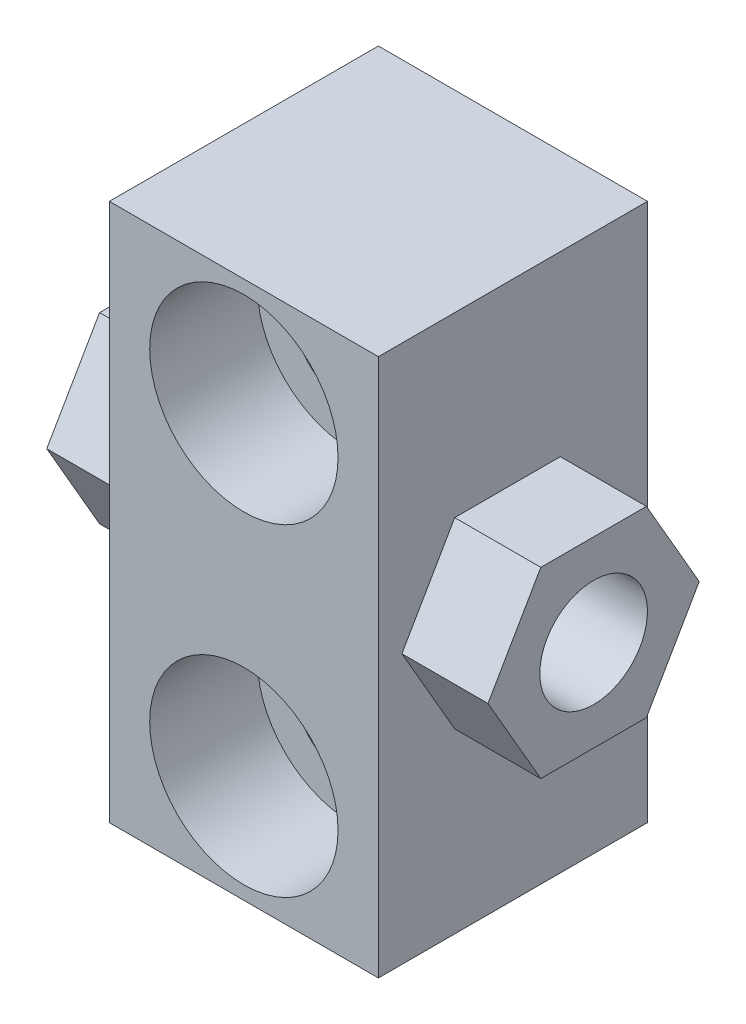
ISO-10303-21;
HEADER;
FILE_DESCRIPTION(('STEP AP214'),'2;1');
FILE_NAME('part.step','',(''),(''),'','','');
FILE_SCHEMA(('AUTOMOTIVE_DESIGN { 1 0 10303 214 1 1 1 1 }'));
ENDSEC;
DATA;
#1=APPLICATION_CONTEXT('core data for automotive mechanical design processes');
#2=APPLICATION_PROTOCOL_DEFINITION('international standard','automotive_design',2000,#1);
#3=PRODUCT_CONTEXT('',#1,'mechanical');
#4=PRODUCT('Part','Part','',(#3));
#5=PRODUCT_RELATED_PRODUCT_CATEGORY('part','',(#4));
#6=PRODUCT_DEFINITION_FORMATION('','',#4);
#7=PRODUCT_DEFINITION_CONTEXT('part definition',#1,'design');
#8=PRODUCT_DEFINITION('design','',#6,#7);
#9=PRODUCT_DEFINITION_SHAPE('','',#8);
#10=(LENGTH_UNIT() NAMED_UNIT(*) SI_UNIT(.MILLI.,.METRE.));
#11=(NAMED_UNIT(*) PLANE_ANGLE_UNIT() SI_UNIT($,.RADIAN.));
#12=(NAMED_UNIT(*) SI_UNIT($,.STERADIAN.) SOLID_ANGLE_UNIT());
#13=UNCERTAINTY_MEASURE_WITH_UNIT(LENGTH_MEASURE(1.E-05),#10,'distance_accuracy_value','');
#14=(GEOMETRIC_REPRESENTATION_CONTEXT(3) GLOBAL_UNCERTAINTY_ASSIGNED_CONTEXT((#13)) GLOBAL_UNIT_ASSIGNED_CONTEXT((#10,
#11,#12)) REPRESENTATION_CONTEXT('',''));
#15=CARTESIAN_POINT('',(0.,0.,0.));
#16=DIRECTION('',(0.,0.,1.));
#17=DIRECTION('',(1.,0.,0.));
#18=AXIS2_PLACEMENT_3D('',#15,#16,#17);
#19=CARTESIAN_POINT('',(0.,30.,25.5));
#20=DIRECTION('',(0.,0.,1.));
#21=DIRECTION('',(-1.,0.,0.));
#22=AXIS2_PLACEMENT_3D('',#19,#20,#21);
#23=CYLINDRICAL_SURFACE('',#22,5.5);
#24=CARTESIAN_POINT('',(0.,30.,0.));
#25=DIRECTION('',(0.,0.,-1.));
#26=DIRECTION('',(1.,0.,0.));
#27=AXIS2_PLACEMENT_3D('',#24,#25,#26);
#28=CIRCLE('',#27,5.5);
#29=CARTESIAN_POINT('',(5.5,30.,0.));
#30=VERTEX_POINT('',#29);
#31=EDGE_CURVE('E285',#30,#30,#28,.T.);
#32=ORIENTED_EDGE('',*,*,#31,.T.);
#33=EDGE_LOOP('',(#32));
#34=FACE_BOUND('',#33,.T.);
#35=CARTESIAN_POINT('',(0.,30.,15.));
#36=DIRECTION('',(0.,0.,1.));
#37=DIRECTION('',(-1.,0.,0.));
#38=AXIS2_PLACEMENT_3D('',#35,#36,#37);
#39=CIRCLE('',#38,5.5);
#40=CARTESIAN_POINT('',(-5.5,30.,15.));
#41=VERTEX_POINT('',#40);
#42=EDGE_CURVE('E18',#41,#41,#39,.T.);
#43=ORIENTED_EDGE('',*,*,#42,.T.);
#44=EDGE_LOOP('',(#43));
#45=FACE_BOUND('',#44,.T.);
#46=ADVANCED_FACE('F14',(#34,#45),#23,.F.);
#47=CARTESIAN_POINT('',(0.,0.,25.5));
#48=DIRECTION('',(0.,0.,1.));
#49=DIRECTION('',(-1.,0.,0.));
#50=AXIS2_PLACEMENT_3D('',#47,#48,#49);
#51=CYLINDRICAL_SURFACE('',#50,5.5);
#52=CARTESIAN_POINT('',(0.,0.,0.));
#53=DIRECTION('',(0.,0.,-1.));
#54=DIRECTION('',(1.,0.,0.));
#55=AXIS2_PLACEMENT_3D('',#52,#53,#54);
#56=CIRCLE('',#55,5.5);
#57=CARTESIAN_POINT('',(5.5,0.,0.));
#58=VERTEX_POINT('',#57);
#59=EDGE_CURVE('E288',#58,#58,#56,.T.);
#60=ORIENTED_EDGE('',*,*,#59,.T.);
#61=EDGE_LOOP('',(#60));
#62=FACE_BOUND('',#61,.T.);
#63=CARTESIAN_POINT('',(0.,0.,15.));
#64=DIRECTION('',(0.,0.,1.));
#65=DIRECTION('',(-1.,0.,0.));
#66=AXIS2_PLACEMENT_3D('',#63,#64,#65);
#67=CIRCLE('',#66,5.5);
#68=CARTESIAN_POINT('',(-5.5,0.,15.));
#69=VERTEX_POINT('',#68);
#70=EDGE_CURVE('E267',#69,#69,#67,.T.);
#71=ORIENTED_EDGE('',*,*,#70,.T.);
#72=EDGE_LOOP('',(#71));
#73=FACE_BOUND('',#72,.T.);
#74=ADVANCED_FACE('F310',(#62,#73),#51,.F.);
#75=CARTESIAN_POINT('',(12.5,40.,0.5));
#76=DIRECTION('',(-1.,0.,0.));
#77=DIRECTION('',(0.,-1.,0.));
#78=AXIS2_PLACEMENT_3D('',#75,#76,#77);
#79=PLANE('',#78);
#80=DIRECTION('',(0.,-0.866025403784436,0.5));
#81=VECTOR('',#80,1.);
#82=CARTESIAN_POINT('',(12.5,23.5,17.9074772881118));
#83=LINE('',#82,#81);
#84=CARTESIAN_POINT('',(12.5,23.5,17.9074772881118));
#85=VERTEX_POINT('',#84);
#86=CARTESIAN_POINT('',(12.5,15.,22.8149545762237));
#87=VERTEX_POINT('',#86);
#88=EDGE_CURVE('E39',#85,#87,#83,.T.);
#89=ORIENTED_EDGE('',*,*,#88,.F.);
#90=DIRECTION('',(0.,0.,-1.));
#91=VECTOR('',#90,1.);
#92=CARTESIAN_POINT('',(12.5,23.5,17.9074772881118));
#93=LINE('',#92,#91);
#94=CARTESIAN_POINT('',(12.5,23.5,8.0925227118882));
#95=VERTEX_POINT('',#94);
#96=EDGE_CURVE('E163',#85,#95,#93,.T.);
#97=ORIENTED_EDGE('',*,*,#96,.T.);
#98=DIRECTION('',(0.,-0.866025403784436,-0.5));
#99=VECTOR('',#98,1.);
#100=CARTESIAN_POINT('',(12.5,23.5,8.0925227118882));
#101=LINE('',#100,#99);
#102=CARTESIAN_POINT('',(12.5,15.,3.18504542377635));
#103=VERTEX_POINT('',#102);
#104=EDGE_CURVE('E166',#95,#103,#101,.T.);
#105=ORIENTED_EDGE('',*,*,#104,.T.);
#106=DIRECTION('',(0.,0.866025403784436,-0.5));
#107=VECTOR('',#106,1.);
#108=CARTESIAN_POINT('',(12.5,6.5,8.0925227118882));
#109=LINE('',#108,#107);
#110=CARTESIAN_POINT('',(12.5,6.5,8.0925227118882));
#111=VERTEX_POINT('',#110);
#112=EDGE_CURVE('E169',#111,#103,#109,.T.);
#113=ORIENTED_EDGE('',*,*,#112,.F.);
#114=DIRECTION('',(0.,0.,-1.));
#115=VECTOR('',#114,1.);
#116=CARTESIAN_POINT('',(12.5,6.5,17.9074772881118));
#117=LINE('',#116,#115);
#118=CARTESIAN_POINT('',(12.5,6.5,17.9074772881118));
#119=VERTEX_POINT('',#118);
#120=EDGE_CURVE('E172',#119,#111,#117,.T.);
#121=ORIENTED_EDGE('',*,*,#120,.F.);
#122=DIRECTION('',(0.,0.866025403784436,0.5));
#123=VECTOR('',#122,1.);
#124=CARTESIAN_POINT('',(12.5,6.5,17.9074772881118));
#125=LINE('',#124,#123);
#126=EDGE_CURVE('E175',#119,#87,#125,.T.);
#127=ORIENTED_EDGE('',*,*,#126,.T.);
#128=EDGE_LOOP('',(#89,#97,#105,#113,#121,#127));
#129=FACE_BOUND('',#128,.T.);
#130=DIRECTION('',(0.,1.,0.));
#131=VECTOR('',#130,1.);
#132=CARTESIAN_POINT('',(12.5,-10.,25.));
#133=LINE('',#132,#131);
#134=CARTESIAN_POINT('',(12.5,-10.,25.));
#135=VERTEX_POINT('',#134);
#136=CARTESIAN_POINT('',(12.5,40.,25.));
#137=VERTEX_POINT('',#136);
#138=EDGE_CURVE('E127',#135,#137,#133,.T.);
#139=ORIENTED_EDGE('',*,*,#138,.F.);
#140=DIRECTION('',(0.,0.,1.));
#141=VECTOR('',#140,1.);
#142=CARTESIAN_POINT('',(12.5,-10.,0.5));
#143=LINE('',#142,#141);
#144=CARTESIAN_POINT('',(12.5,-10.,0.));
#145=VERTEX_POINT('',#144);
#146=EDGE_CURVE('E23',#145,#135,#143,.T.);
#147=ORIENTED_EDGE('',*,*,#146,.F.);
#148=DIRECTION('',(0.,-1.,0.));
#149=VECTOR('',#148,1.);
#150=CARTESIAN_POINT('',(12.5,40.,0.));
#151=LINE('',#150,#149);
#152=CARTESIAN_POINT('',(12.5,40.,0.));
#153=VERTEX_POINT('',#152);
#154=EDGE_CURVE('E144',#153,#145,#151,.T.);
#155=ORIENTED_EDGE('',*,*,#154,.F.);
#156=DIRECTION('',(0.,0.,1.));
#157=VECTOR('',#156,1.);
#158=CARTESIAN_POINT('',(12.5,40.,0.5));
#159=LINE('',#158,#157);
#160=EDGE_CURVE('E9',#153,#137,#159,.T.);
#161=ORIENTED_EDGE('',*,*,#160,.T.);
#162=EDGE_LOOP('',(#139,#147,#155,#161));
#163=FACE_BOUND('',#162,.T.);
#164=ADVANCED_FACE('F16',(#129,#163),#79,.F.);
#165=CARTESIAN_POINT('',(12.5,40.,0.5));
#166=DIRECTION('',(0.,1.,0.));
#167=DIRECTION('',(-1.,0.,0.));
#168=AXIS2_PLACEMENT_3D('',#165,#166,#167);
#169=PLANE('',#168);
#170=DIRECTION('',(0.,0.,1.));
#171=VECTOR('',#170,1.);
#172=CARTESIAN_POINT('',(-12.5,40.,0.5));
#173=LINE('',#172,#171);
#174=CARTESIAN_POINT('',(-12.5,40.,0.));
#175=VERTEX_POINT('',#174);
#176=CARTESIAN_POINT('',(-12.5,40.,25.));
#177=VERTEX_POINT('',#176);
#178=EDGE_CURVE('E139',#175,#177,#173,.T.);
#179=ORIENTED_EDGE('',*,*,#178,.T.);
#180=DIRECTION('',(-1.,0.,0.));
#181=VECTOR('',#180,1.);
#182=CARTESIAN_POINT('',(12.5,40.,25.));
#183=LINE('',#182,#181);
#184=EDGE_CURVE('E31',#137,#177,#183,.T.);
#185=ORIENTED_EDGE('',*,*,#184,.F.);
#186=ORIENTED_EDGE('',*,*,#160,.F.);
#187=DIRECTION('',(1.,0.,0.));
#188=VECTOR('',#187,1.);
#189=CARTESIAN_POINT('',(-12.5,40.,0.));
#190=LINE('',#189,#188);
#191=EDGE_CURVE('E149',#175,#153,#190,.T.);
#192=ORIENTED_EDGE('',*,*,#191,.F.);
#193=EDGE_LOOP('',(#179,#185,#186,#192));
#194=FACE_BOUND('',#193,.T.);
#195=ADVANCED_FACE('F136',(#194),#169,.T.);
#196=CARTESIAN_POINT('',(-12.5,-10.,0.5));
#197=DIRECTION('',(0.,-1.,0.));
#198=DIRECTION('',(1.,0.,0.));
#199=AXIS2_PLACEMENT_3D('',#196,#197,#198);
#200=PLANE('',#199);
#201=ORIENTED_EDGE('',*,*,#146,.T.);
#202=DIRECTION('',(1.,0.,0.));
#203=VECTOR('',#202,1.);
#204=CARTESIAN_POINT('',(-12.5,-10.,25.));
#205=LINE('',#204,#203);
#206=CARTESIAN_POINT('',(-12.5,-10.,25.));
#207=VERTEX_POINT('',#206);
#208=EDGE_CURVE('E130',#207,#135,#205,.T.);
#209=ORIENTED_EDGE('',*,*,#208,.F.);
#210=DIRECTION('',(0.,0.,1.));
#211=VECTOR('',#210,1.);
#212=CARTESIAN_POINT('',(-12.5,-10.,0.5));
#213=LINE('',#212,#211);
#214=CARTESIAN_POINT('',(-12.5,-10.,0.));
#215=VERTEX_POINT('',#214);
#216=EDGE_CURVE('E260',#215,#207,#213,.T.);
#217=ORIENTED_EDGE('',*,*,#216,.F.);
#218=DIRECTION('',(-1.,0.,0.));
#219=VECTOR('',#218,1.);
#220=CARTESIAN_POINT('',(12.5,-10.,0.));
#221=LINE('',#220,#219);
#222=EDGE_CURVE('E148',#145,#215,#221,.T.);
#223=ORIENTED_EDGE('',*,*,#222,.F.);
#224=EDGE_LOOP('',(#201,#209,#217,#223));
#225=FACE_BOUND('',#224,.T.);
#226=ADVANCED_FACE('F297',(#225),#200,.T.);
#227=CARTESIAN_POINT('',(-12.5,-10.,0.5));
#228=DIRECTION('',(1.,0.,0.));
#229=DIRECTION('',(0.,1.,0.));
#230=AXIS2_PLACEMENT_3D('',#227,#228,#229);
#231=PLANE('',#230);
#232=DIRECTION('',(0.,0.,-1.));
#233=VECTOR('',#232,1.);
#234=CARTESIAN_POINT('',(-12.5,23.5,17.9074772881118));
#235=LINE('',#234,#233);
#236=CARTESIAN_POINT('',(-12.5,23.5,17.9074772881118));
#237=VERTEX_POINT('',#236);
#238=CARTESIAN_POINT('',(-12.5,23.5,8.0925227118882));
#239=VERTEX_POINT('',#238);
#240=EDGE_CURVE('E220',#237,#239,#235,.T.);
#241=ORIENTED_EDGE('',*,*,#240,.F.);
#242=DIRECTION('',(0.,-0.866025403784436,0.5));
#243=VECTOR('',#242,1.);
#244=CARTESIAN_POINT('',(-12.5,23.5,17.9074772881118));
#245=LINE('',#244,#243);
#246=CARTESIAN_POINT('',(-12.5,15.,22.8149545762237));
#247=VERTEX_POINT('',#246);
#248=EDGE_CURVE('E208',#237,#247,#245,.T.);
#249=ORIENTED_EDGE('',*,*,#248,.T.);
#250=DIRECTION('',(0.,0.866025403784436,0.5));
#251=VECTOR('',#250,1.);
#252=CARTESIAN_POINT('',(-12.5,6.5,17.9074772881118));
#253=LINE('',#252,#251);
#254=CARTESIAN_POINT('',(-12.5,6.5,17.9074772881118));
#255=VERTEX_POINT('',#254);
#256=EDGE_CURVE('E210',#255,#247,#253,.T.);
#257=ORIENTED_EDGE('',*,*,#256,.F.);
#258=DIRECTION('',(0.,0.,-1.));
#259=VECTOR('',#258,1.);
#260=CARTESIAN_POINT('',(-12.5,6.5,17.9074772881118));
#261=LINE('',#260,#259);
#262=CARTESIAN_POINT('',(-12.5,6.5,8.0925227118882));
#263=VERTEX_POINT('',#262);
#264=EDGE_CURVE('E213',#255,#263,#261,.T.);
#265=ORIENTED_EDGE('',*,*,#264,.T.);
#266=DIRECTION('',(0.,0.866025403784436,-0.5));
#267=VECTOR('',#266,1.);
#268=CARTESIAN_POINT('',(-12.5,6.5,8.0925227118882));
#269=LINE('',#268,#267);
#270=CARTESIAN_POINT('',(-12.5,15.,3.18504542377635));
#271=VERTEX_POINT('',#270);
#272=EDGE_CURVE('E215',#263,#271,#269,.T.);
#273=ORIENTED_EDGE('',*,*,#272,.T.);
#274=DIRECTION('',(0.,-0.866025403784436,-0.5));
#275=VECTOR('',#274,1.);
#276=CARTESIAN_POINT('',(-12.5,23.5,8.0925227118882));
#277=LINE('',#276,#275);
#278=EDGE_CURVE('E217',#239,#271,#277,.T.);
#279=ORIENTED_EDGE('',*,*,#278,.F.);
#280=EDGE_LOOP('',(#241,#249,#257,#265,#273,#279));
#281=FACE_BOUND('',#280,.T.);
#282=DIRECTION('',(0.,-1.,0.));
#283=VECTOR('',#282,1.);
#284=CARTESIAN_POINT('',(-12.5,40.,25.));
#285=LINE('',#284,#283);
#286=EDGE_CURVE('E140',#177,#207,#285,.T.);
#287=ORIENTED_EDGE('',*,*,#286,.F.);
#288=ORIENTED_EDGE('',*,*,#178,.F.);
#289=DIRECTION('',(0.,1.,0.));
#290=VECTOR('',#289,1.);
#291=CARTESIAN_POINT('',(-12.5,-10.,0.));
#292=LINE('',#291,#290);
#293=EDGE_CURVE('E153',#215,#175,#292,.T.);
#294=ORIENTED_EDGE('',*,*,#293,.F.);
#295=ORIENTED_EDGE('',*,*,#216,.T.);
#296=EDGE_LOOP('',(#287,#288,#294,#295));
#297=FACE_BOUND('',#296,.T.);
#298=ADVANCED_FACE('F295',(#281,#297),#231,.F.);
#299=CARTESIAN_POINT('',(0.,30.,25.5));
#300=DIRECTION('',(0.,0.,1.));
#301=DIRECTION('',(-1.,0.,0.));
#302=AXIS2_PLACEMENT_3D('',#299,#300,#301);
#303=CYLINDRICAL_SURFACE('',#302,8.75);
#304=CARTESIAN_POINT('',(0.,30.,25.));
#305=DIRECTION('',(0.,0.,1.));
#306=DIRECTION('',(-1.,0.,0.));
#307=AXIS2_PLACEMENT_3D('',#304,#305,#306);
#308=CIRCLE('',#307,8.75);
#309=CARTESIAN_POINT('',(-8.75,30.,25.));
#310=VERTEX_POINT('',#309);
#311=EDGE_CURVE('E266',#310,#310,#308,.T.);
#312=ORIENTED_EDGE('',*,*,#311,.T.);
#313=EDGE_LOOP('',(#312));
#314=FACE_BOUND('',#313,.T.);
#315=CARTESIAN_POINT('',(0.,30.,15.));
#316=DIRECTION('',(0.,0.,1.));
#317=DIRECTION('',(-1.,0.,0.));
#318=AXIS2_PLACEMENT_3D('',#315,#316,#317);
#319=CIRCLE('',#318,8.75);
#320=CARTESIAN_POINT('',(-8.75,30.,15.));
#321=VERTEX_POINT('',#320);
#322=EDGE_CURVE('E269',#321,#321,#319,.T.);
#323=ORIENTED_EDGE('',*,*,#322,.F.);
#324=EDGE_LOOP('',(#323));
#325=FACE_BOUND('',#324,.T.);
#326=ADVANCED_FACE('F305',(#314,#325),#303,.F.);
#327=CARTESIAN_POINT('',(0.,0.,25.5));
#328=DIRECTION('',(0.,0.,1.));
#329=DIRECTION('',(-1.,0.,0.));
#330=AXIS2_PLACEMENT_3D('',#327,#328,#329);
#331=CYLINDRICAL_SURFACE('',#330,8.75);
#332=CARTESIAN_POINT('',(0.,0.,25.));
#333=DIRECTION('',(0.,0.,1.));
#334=DIRECTION('',(-1.,0.,0.));
#335=AXIS2_PLACEMENT_3D('',#332,#333,#334);
#336=CIRCLE('',#335,8.75);
#337=CARTESIAN_POINT('',(-8.75,0.,25.));
#338=VERTEX_POINT('',#337);
#339=EDGE_CURVE('E264',#338,#338,#336,.T.);
#340=ORIENTED_EDGE('',*,*,#339,.T.);
#341=EDGE_LOOP('',(#340));
#342=FACE_BOUND('',#341,.T.);
#343=CARTESIAN_POINT('',(0.,0.,15.));
#344=DIRECTION('',(0.,0.,1.));
#345=DIRECTION('',(-1.,0.,0.));
#346=AXIS2_PLACEMENT_3D('',#343,#344,#345);
#347=CIRCLE('',#346,8.75);
#348=CARTESIAN_POINT('',(-8.75,0.,15.));
#349=VERTEX_POINT('',#348);
#350=EDGE_CURVE('E274',#349,#349,#347,.T.);
#351=ORIENTED_EDGE('',*,*,#350,.F.);
#352=EDGE_LOOP('',(#351));
#353=FACE_BOUND('',#352,.T.);
#354=ADVANCED_FACE('F322',(#342,#353),#331,.F.);
#355=CARTESIAN_POINT('',(-20.5,23.5,17.9074772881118));
#356=DIRECTION('',(0.,0.5,0.866025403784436));
#357=DIRECTION('',(0.,0.866025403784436,-0.5));
#358=AXIS2_PLACEMENT_3D('',#355,#356,#357);
#359=PLANE('',#358);
#360=DIRECTION('',(1.,0.,0.));
#361=VECTOR('',#360,1.);
#362=CARTESIAN_POINT('',(-20.5,23.5,17.9074772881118));
#363=LINE('',#362,#361);
#364=CARTESIAN_POINT('',(-20.5,23.5,17.9074772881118));
#365=VERTEX_POINT('',#364);
#366=EDGE_CURVE('E256',#365,#237,#363,.T.);
#367=ORIENTED_EDGE('',*,*,#366,.F.);
#368=DIRECTION('',(0.,-0.866025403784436,0.5));
#369=VECTOR('',#368,1.);
#370=CARTESIAN_POINT('',(-20.5,23.5,17.9074772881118));
#371=LINE('',#370,#369);
#372=CARTESIAN_POINT('',(-20.5,15.,22.8149545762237));
#373=VERTEX_POINT('',#372);
#374=EDGE_CURVE('E223',#365,#373,#371,.T.);
#375=ORIENTED_EDGE('',*,*,#374,.T.);
#376=DIRECTION('',(1.,0.,0.));
#377=VECTOR('',#376,1.);
#378=CARTESIAN_POINT('',(-20.5,15.,22.8149545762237));
#379=LINE('',#378,#377);
#380=EDGE_CURVE('E241',#373,#247,#379,.T.);
#381=ORIENTED_EDGE('',*,*,#380,.T.);
#382=ORIENTED_EDGE('',*,*,#248,.F.);
#383=EDGE_LOOP('',(#367,#375,#381,#382));
#384=FACE_BOUND('',#383,.T.);
#385=ADVANCED_FACE('F327',(#384),#359,.T.);
#386=CARTESIAN_POINT('',(-20.5,23.5,17.9074772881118));
#387=DIRECTION('',(0.,-1.,0.));
#388=DIRECTION('',(1.,0.,0.));
#389=AXIS2_PLACEMENT_3D('',#386,#387,#388);
#390=PLANE('',#389);
#391=DIRECTION('',(1.,0.,0.));
#392=VECTOR('',#391,1.);
#393=CARTESIAN_POINT('',(-20.5,23.5,8.0925227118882));
#394=LINE('',#393,#392);
#395=CARTESIAN_POINT('',(-20.5,23.5,8.0925227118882));
#396=VERTEX_POINT('',#395);
#397=EDGE_CURVE('E253',#396,#239,#394,.T.);
#398=ORIENTED_EDGE('',*,*,#397,.F.);
#399=DIRECTION('',(0.,0.,-1.));
#400=VECTOR('',#399,1.);
#401=CARTESIAN_POINT('',(-20.5,23.5,17.9074772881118));
#402=LINE('',#401,#400);
#403=EDGE_CURVE('E238',#365,#396,#402,.T.);
#404=ORIENTED_EDGE('',*,*,#403,.F.);
#405=ORIENTED_EDGE('',*,*,#366,.T.);
#406=ORIENTED_EDGE('',*,*,#240,.T.);
#407=EDGE_LOOP('',(#398,#404,#405,#406));
#408=FACE_BOUND('',#407,.T.);
#409=ADVANCED_FACE('F329',(#408),#390,.F.);
#410=CARTESIAN_POINT('',(-20.5,23.5,8.0925227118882));
#411=DIRECTION('',(0.,-0.5,0.866025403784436));
#412=DIRECTION('',(0.,0.866025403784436,0.5));
#413=AXIS2_PLACEMENT_3D('',#410,#411,#412);
#414=PLANE('',#413);
#415=DIRECTION('',(1.,0.,0.));
#416=VECTOR('',#415,1.);
#417=CARTESIAN_POINT('',(-20.5,15.,3.18504542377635));
#418=LINE('',#417,#416);
#419=CARTESIAN_POINT('',(-20.5,15.,3.18504542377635));
#420=VERTEX_POINT('',#419);
#421=EDGE_CURVE('E250',#420,#271,#418,.T.);
#422=ORIENTED_EDGE('',*,*,#421,.F.);
#423=DIRECTION('',(0.,-0.866025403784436,-0.5));
#424=VECTOR('',#423,1.);
#425=CARTESIAN_POINT('',(-20.5,23.5,8.0925227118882));
#426=LINE('',#425,#424);
#427=EDGE_CURVE('E235',#396,#420,#426,.T.);
#428=ORIENTED_EDGE('',*,*,#427,.F.);
#429=ORIENTED_EDGE('',*,*,#397,.T.);
#430=ORIENTED_EDGE('',*,*,#278,.T.);
#431=EDGE_LOOP('',(#422,#428,#429,#430));
#432=FACE_BOUND('',#431,.T.);
#433=ADVANCED_FACE('F332',(#432),#414,.F.);
#434=CARTESIAN_POINT('',(-20.5,6.5,8.0925227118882));
#435=DIRECTION('',(0.,-0.5,-0.866025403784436));
#436=DIRECTION('',(0.,-0.866025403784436,0.5));
#437=AXIS2_PLACEMENT_3D('',#434,#435,#436);
#438=PLANE('',#437);
#439=DIRECTION('',(1.,0.,0.));
#440=VECTOR('',#439,1.);
#441=CARTESIAN_POINT('',(-20.5,6.5,8.0925227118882));
#442=LINE('',#441,#440);
#443=CARTESIAN_POINT('',(-20.5,6.5,8.0925227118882));
#444=VERTEX_POINT('',#443);
#445=EDGE_CURVE('E247',#444,#263,#442,.T.);
#446=ORIENTED_EDGE('',*,*,#445,.F.);
#447=DIRECTION('',(0.,0.866025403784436,-0.5));
#448=VECTOR('',#447,1.);
#449=CARTESIAN_POINT('',(-20.5,6.5,8.0925227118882));
#450=LINE('',#449,#448);
#451=EDGE_CURVE('E232',#444,#420,#450,.T.);
#452=ORIENTED_EDGE('',*,*,#451,.T.);
#453=ORIENTED_EDGE('',*,*,#421,.T.);
#454=ORIENTED_EDGE('',*,*,#272,.F.);
#455=EDGE_LOOP('',(#446,#452,#453,#454));
#456=FACE_BOUND('',#455,.T.);
#457=ADVANCED_FACE('F336',(#456),#438,.T.);
#458=CARTESIAN_POINT('',(-20.5,6.5,17.9074772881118));
#459=DIRECTION('',(0.,-1.,0.));
#460=DIRECTION('',(1.,0.,0.));
#461=AXIS2_PLACEMENT_3D('',#458,#459,#460);
#462=PLANE('',#461);
#463=DIRECTION('',(1.,0.,0.));
#464=VECTOR('',#463,1.);
#465=CARTESIAN_POINT('',(-20.5,6.5,17.9074772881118));
#466=LINE('',#465,#464);
#467=CARTESIAN_POINT('',(-20.5,6.5,17.9074772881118));
#468=VERTEX_POINT('',#467);
#469=EDGE_CURVE('E244',#468,#255,#466,.T.);
#470=ORIENTED_EDGE('',*,*,#469,.F.);
#471=DIRECTION('',(0.,0.,-1.));
#472=VECTOR('',#471,1.);
#473=CARTESIAN_POINT('',(-20.5,6.5,17.9074772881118));
#474=LINE('',#473,#472);
#475=EDGE_CURVE('E229',#468,#444,#474,.T.);
#476=ORIENTED_EDGE('',*,*,#475,.T.);
#477=ORIENTED_EDGE('',*,*,#445,.T.);
#478=ORIENTED_EDGE('',*,*,#264,.F.);
#479=EDGE_LOOP('',(#470,#476,#477,#478));
#480=FACE_BOUND('',#479,.T.);
#481=ADVANCED_FACE('F340',(#480),#462,.T.);
#482=CARTESIAN_POINT('',(-20.5,6.5,17.9074772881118));
#483=DIRECTION('',(0.,0.5,-0.866025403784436));
#484=DIRECTION('',(0.,-0.866025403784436,-0.5));
#485=AXIS2_PLACEMENT_3D('',#482,#483,#484);
#486=PLANE('',#485);
#487=DIRECTION('',(0.,0.866025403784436,0.5));
#488=VECTOR('',#487,1.);
#489=CARTESIAN_POINT('',(-20.5,6.5,17.9074772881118));
#490=LINE('',#489,#488);
#491=EDGE_CURVE('E226',#468,#373,#490,.T.);
#492=ORIENTED_EDGE('',*,*,#491,.F.);
#493=ORIENTED_EDGE('',*,*,#469,.T.);
#494=ORIENTED_EDGE('',*,*,#256,.T.);
#495=ORIENTED_EDGE('',*,*,#380,.F.);
#496=EDGE_LOOP('',(#492,#493,#494,#495));
#497=FACE_BOUND('',#496,.T.);
#498=ADVANCED_FACE('F344',(#497),#486,.F.);
#499=CARTESIAN_POINT('',(-20.5,15.,22.8149545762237));
#500=DIRECTION('',(-1.,0.,0.));
#501=DIRECTION('',(0.,-1.,0.));
#502=AXIS2_PLACEMENT_3D('',#499,#500,#501);
#503=PLANE('',#502);
#504=CARTESIAN_POINT('',(-20.5,15.,13.));
#505=DIRECTION('',(-1.,0.,0.));
#506=DIRECTION('',(0.,-1.,0.));
#507=AXIS2_PLACEMENT_3D('',#504,#505,#506);
#508=CIRCLE('',#507,5.);
#509=CARTESIAN_POINT('',(-20.5,10.,13.));
#510=VERTEX_POINT('',#509);
#511=EDGE_CURVE('E151',#510,#510,#508,.T.);
#512=ORIENTED_EDGE('',*,*,#511,.F.);
#513=EDGE_LOOP('',(#512));
#514=FACE_BOUND('',#513,.T.);
#515=ORIENTED_EDGE('',*,*,#374,.F.);
#516=ORIENTED_EDGE('',*,*,#403,.T.);
#517=ORIENTED_EDGE('',*,*,#427,.T.);
#518=ORIENTED_EDGE('',*,*,#451,.F.);
#519=ORIENTED_EDGE('',*,*,#475,.F.);
#520=ORIENTED_EDGE('',*,*,#491,.T.);
#521=EDGE_LOOP('',(#515,#516,#517,#518,#519,#520));
#522=FACE_BOUND('',#521,.T.);
#523=ADVANCED_FACE('F346',(#514,#522),#503,.T.);
#524=CARTESIAN_POINT('',(20.5,23.5,17.9074772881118));
#525=DIRECTION('',(0.,-0.5,-0.866025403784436));
#526=DIRECTION('',(0.,-0.866025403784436,0.5));
#527=AXIS2_PLACEMENT_3D('',#524,#525,#526);
#528=PLANE('',#527);
#529=DIRECTION('',(-1.,0.,0.));
#530=VECTOR('',#529,1.);
#531=CARTESIAN_POINT('',(20.5,15.,22.8149545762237));
#532=LINE('',#531,#530);
#533=CARTESIAN_POINT('',(20.5,15.,22.8149545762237));
#534=VERTEX_POINT('',#533);
#535=EDGE_CURVE('E206',#534,#87,#532,.T.);
#536=ORIENTED_EDGE('',*,*,#535,.F.);
#537=DIRECTION('',(0.,-0.866025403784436,0.5));
#538=VECTOR('',#537,1.);
#539=CARTESIAN_POINT('',(20.5,23.5,17.9074772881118));
#540=LINE('',#539,#538);
#541=CARTESIAN_POINT('',(20.5,23.5,17.9074772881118));
#542=VERTEX_POINT('',#541);
#543=EDGE_CURVE('E178',#542,#534,#540,.T.);
#544=ORIENTED_EDGE('',*,*,#543,.F.);
#545=DIRECTION('',(-1.,0.,0.));
#546=VECTOR('',#545,1.);
#547=CARTESIAN_POINT('',(20.5,23.5,17.9074772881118));
#548=LINE('',#547,#546);
#549=EDGE_CURVE('E196',#542,#85,#548,.T.);
#550=ORIENTED_EDGE('',*,*,#549,.T.);
#551=ORIENTED_EDGE('',*,*,#88,.T.);
#552=EDGE_LOOP('',(#536,#544,#550,#551));
#553=FACE_BOUND('',#552,.T.);
#554=ADVANCED_FACE('F350',(#553),#528,.F.);
#555=CARTESIAN_POINT('',(20.5,6.5,17.9074772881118));
#556=DIRECTION('',(0.,-0.5,0.866025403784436));
#557=DIRECTION('',(0.,0.866025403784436,0.5));
#558=AXIS2_PLACEMENT_3D('',#555,#556,#557);
#559=PLANE('',#558);
#560=DIRECTION('',(-1.,0.,0.));
#561=VECTOR('',#560,1.);
#562=CARTESIAN_POINT('',(20.5,6.5,17.9074772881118));
#563=LINE('',#562,#561);
#564=CARTESIAN_POINT('',(20.5,6.5,17.9074772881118));
#565=VERTEX_POINT('',#564);
#566=EDGE_CURVE('E204',#565,#119,#563,.T.);
#567=ORIENTED_EDGE('',*,*,#566,.F.);
#568=DIRECTION('',(0.,0.866025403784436,0.5));
#569=VECTOR('',#568,1.);
#570=CARTESIAN_POINT('',(20.5,6.5,17.9074772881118));
#571=LINE('',#570,#569);
#572=EDGE_CURVE('E193',#565,#534,#571,.T.);
#573=ORIENTED_EDGE('',*,*,#572,.T.);
#574=ORIENTED_EDGE('',*,*,#535,.T.);
#575=ORIENTED_EDGE('',*,*,#126,.F.);
#576=EDGE_LOOP('',(#567,#573,#574,#575));
#577=FACE_BOUND('',#576,.T.);
#578=ADVANCED_FACE('F357',(#577),#559,.T.);
#579=CARTESIAN_POINT('',(20.5,6.5,17.9074772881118));
#580=DIRECTION('',(0.,1.,0.));
#581=DIRECTION('',(-1.,0.,0.));
#582=AXIS2_PLACEMENT_3D('',#579,#580,#581);
#583=PLANE('',#582);
#584=DIRECTION('',(-1.,0.,0.));
#585=VECTOR('',#584,1.);
#586=CARTESIAN_POINT('',(20.5,6.5,8.0925227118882));
#587=LINE('',#586,#585);
#588=CARTESIAN_POINT('',(20.5,6.5,8.0925227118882));
#589=VERTEX_POINT('',#588);
#590=EDGE_CURVE('E202',#589,#111,#587,.T.);
#591=ORIENTED_EDGE('',*,*,#590,.F.);
#592=DIRECTION('',(0.,0.,-1.));
#593=VECTOR('',#592,1.);
#594=CARTESIAN_POINT('',(20.5,6.5,17.9074772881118));
#595=LINE('',#594,#593);
#596=EDGE_CURVE('E190',#565,#589,#595,.T.);
#597=ORIENTED_EDGE('',*,*,#596,.F.);
#598=ORIENTED_EDGE('',*,*,#566,.T.);
#599=ORIENTED_EDGE('',*,*,#120,.T.);
#600=EDGE_LOOP('',(#591,#597,#598,#599));
#601=FACE_BOUND('',#600,.T.);
#602=ADVANCED_FACE('F360',(#601),#583,.F.);
#603=CARTESIAN_POINT('',(20.5,6.5,8.0925227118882));
#604=DIRECTION('',(0.,0.5,0.866025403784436));
#605=DIRECTION('',(0.,0.866025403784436,-0.5));
#606=AXIS2_PLACEMENT_3D('',#603,#604,#605);
#607=PLANE('',#606);
#608=DIRECTION('',(-1.,0.,0.));
#609=VECTOR('',#608,1.);
#610=CARTESIAN_POINT('',(20.5,15.,3.18504542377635));
#611=LINE('',#610,#609);
#612=CARTESIAN_POINT('',(20.5,15.,3.18504542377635));
#613=VERTEX_POINT('',#612);
#614=EDGE_CURVE('E200',#613,#103,#611,.T.);
#615=ORIENTED_EDGE('',*,*,#614,.F.);
#616=DIRECTION('',(0.,0.866025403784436,-0.5));
#617=VECTOR('',#616,1.);
#618=CARTESIAN_POINT('',(20.5,6.5,8.0925227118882));
#619=LINE('',#618,#617);
#620=EDGE_CURVE('E187',#589,#613,#619,.T.);
#621=ORIENTED_EDGE('',*,*,#620,.F.);
#622=ORIENTED_EDGE('',*,*,#590,.T.);
#623=ORIENTED_EDGE('',*,*,#112,.T.);
#624=EDGE_LOOP('',(#615,#621,#622,#623));
#625=FACE_BOUND('',#624,.T.);
#626=ADVANCED_FACE('F364',(#625),#607,.F.);
#627=CARTESIAN_POINT('',(20.5,23.5,8.0925227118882));
#628=DIRECTION('',(0.,0.5,-0.866025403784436));
#629=DIRECTION('',(0.,-0.866025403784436,-0.5));
#630=AXIS2_PLACEMENT_3D('',#627,#628,#629);
#631=PLANE('',#630);
#632=DIRECTION('',(-1.,0.,0.));
#633=VECTOR('',#632,1.);
#634=CARTESIAN_POINT('',(20.5,23.5,8.0925227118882));
#635=LINE('',#634,#633);
#636=CARTESIAN_POINT('',(20.5,23.5,8.0925227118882));
#637=VERTEX_POINT('',#636);
#638=EDGE_CURVE('E198',#637,#95,#635,.T.);
#639=ORIENTED_EDGE('',*,*,#638,.F.);
#640=DIRECTION('',(0.,-0.866025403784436,-0.5));
#641=VECTOR('',#640,1.);
#642=CARTESIAN_POINT('',(20.5,23.5,8.0925227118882));
#643=LINE('',#642,#641);
#644=EDGE_CURVE('E184',#637,#613,#643,.T.);
#645=ORIENTED_EDGE('',*,*,#644,.T.);
#646=ORIENTED_EDGE('',*,*,#614,.T.);
#647=ORIENTED_EDGE('',*,*,#104,.F.);
#648=EDGE_LOOP('',(#639,#645,#646,#647));
#649=FACE_BOUND('',#648,.T.);
#650=ADVANCED_FACE('F368',(#649),#631,.T.);
#651=CARTESIAN_POINT('',(20.5,23.5,17.9074772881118));
#652=DIRECTION('',(0.,1.,0.));
#653=DIRECTION('',(-1.,0.,0.));
#654=AXIS2_PLACEMENT_3D('',#651,#652,#653);
#655=PLANE('',#654);
#656=DIRECTION('',(0.,0.,-1.));
#657=VECTOR('',#656,1.);
#658=CARTESIAN_POINT('',(20.5,23.5,17.9074772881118));
#659=LINE('',#658,#657);
#660=EDGE_CURVE('E181',#542,#637,#659,.T.);
#661=ORIENTED_EDGE('',*,*,#660,.T.);
#662=ORIENTED_EDGE('',*,*,#638,.T.);
#663=ORIENTED_EDGE('',*,*,#96,.F.);
#664=ORIENTED_EDGE('',*,*,#549,.F.);
#665=EDGE_LOOP('',(#661,#662,#663,#664));
#666=FACE_BOUND('',#665,.T.);
#667=ADVANCED_FACE('F372',(#666),#655,.T.);
#668=CARTESIAN_POINT('',(20.5,15.,22.8149545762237));
#669=DIRECTION('',(1.,0.,0.));
#670=DIRECTION('',(0.,-1.,0.));
#671=AXIS2_PLACEMENT_3D('',#668,#669,#670);
#672=PLANE('',#671);
#673=CARTESIAN_POINT('',(20.5,15.,13.));
#674=DIRECTION('',(-1.,0.,0.));
#675=DIRECTION('',(0.,-1.,0.));
#676=AXIS2_PLACEMENT_3D('',#673,#674,#675);
#677=CIRCLE('',#676,5.);
#678=CARTESIAN_POINT('',(20.5,10.,13.));
#679=VERTEX_POINT('',#678);
#680=EDGE_CURVE('E159',#679,#679,#677,.T.);
#681=ORIENTED_EDGE('',*,*,#680,.T.);
#682=EDGE_LOOP('',(#681));
#683=FACE_BOUND('',#682,.T.);
#684=ORIENTED_EDGE('',*,*,#543,.T.);
#685=ORIENTED_EDGE('',*,*,#572,.F.);
#686=ORIENTED_EDGE('',*,*,#596,.T.);
#687=ORIENTED_EDGE('',*,*,#620,.T.);
#688=ORIENTED_EDGE('',*,*,#644,.F.);
#689=ORIENTED_EDGE('',*,*,#660,.F.);
#690=EDGE_LOOP('',(#684,#685,#686,#687,#688,#689));
#691=FACE_BOUND('',#690,.T.);
#692=ADVANCED_FACE('F374',(#683,#691),#672,.T.);
#693=CARTESIAN_POINT('',(20.5,15.,13.));
#694=DIRECTION('',(-1.,0.,0.));
#695=DIRECTION('',(0.,-1.,0.));
#696=AXIS2_PLACEMENT_3D('',#693,#694,#695);
#697=CYLINDRICAL_SURFACE('',#696,5.);
#698=ORIENTED_EDGE('',*,*,#680,.F.);
#699=EDGE_LOOP('',(#698));
#700=FACE_BOUND('',#699,.T.);
#701=ORIENTED_EDGE('',*,*,#511,.T.);
#702=EDGE_LOOP('',(#701));
#703=FACE_BOUND('',#702,.T.);
#704=ADVANCED_FACE('F378',(#700,#703),#697,.F.);
#705=CARTESIAN_POINT('',(0.,15.,0.));
#706=DIRECTION('',(0.,0.,-1.));
#707=DIRECTION('',(1.,0.,0.));
#708=AXIS2_PLACEMENT_3D('',#705,#706,#707);
#709=PLANE('',#708);
#710=ORIENTED_EDGE('',*,*,#59,.F.);
#711=EDGE_LOOP('',(#710));
#712=FACE_BOUND('',#711,.T.);
#713=ORIENTED_EDGE('',*,*,#293,.T.);
#714=ORIENTED_EDGE('',*,*,#191,.T.);
#715=ORIENTED_EDGE('',*,*,#154,.T.);
#716=ORIENTED_EDGE('',*,*,#222,.T.);
#717=EDGE_LOOP('',(#713,#714,#715,#716));
#718=FACE_BOUND('',#717,.T.);
#719=ORIENTED_EDGE('',*,*,#31,.F.);
#720=EDGE_LOOP('',(#719));
#721=FACE_BOUND('',#720,.T.);
#722=ADVANCED_FACE('F292',(#712,#718,#721),#709,.T.);
#723=CARTESIAN_POINT('',(0.,15.,25.));
#724=DIRECTION('',(0.,0.,1.));
#725=DIRECTION('',(-1.,0.,0.));
#726=AXIS2_PLACEMENT_3D('',#723,#724,#725);
#727=PLANE('',#726);
#728=ORIENTED_EDGE('',*,*,#311,.F.);
#729=EDGE_LOOP('',(#728));
#730=FACE_BOUND('',#729,.T.);
#731=ORIENTED_EDGE('',*,*,#339,.F.);
#732=EDGE_LOOP('',(#731));
#733=FACE_BOUND('',#732,.T.);
#734=ORIENTED_EDGE('',*,*,#138,.T.);
#735=ORIENTED_EDGE('',*,*,#184,.T.);
#736=ORIENTED_EDGE('',*,*,#286,.T.);
#737=ORIENTED_EDGE('',*,*,#208,.T.);
#738=EDGE_LOOP('',(#734,#735,#736,#737));
#739=FACE_BOUND('',#738,.T.);
#740=ADVANCED_FACE('F128',(#730,#733,#739),#727,.T.);
#741=CARTESIAN_POINT('',(0.,0.,15.));
#742=DIRECTION('',(0.,0.,1.));
#743=DIRECTION('',(-1.,0.,0.));
#744=AXIS2_PLACEMENT_3D('',#741,#742,#743);
#745=PLANE('',#744);
#746=ORIENTED_EDGE('',*,*,#70,.F.);
#747=EDGE_LOOP('',(#746));
#748=FACE_BOUND('',#747,.T.);
#749=ORIENTED_EDGE('',*,*,#350,.T.);
#750=EDGE_LOOP('',(#749));
#751=FACE_BOUND('',#750,.T.);
#752=ADVANCED_FACE('F392',(#748,#751),#745,.T.);
#753=CARTESIAN_POINT('',(0.,30.,15.));
#754=DIRECTION('',(0.,0.,1.));
#755=DIRECTION('',(-1.,0.,0.));
#756=AXIS2_PLACEMENT_3D('',#753,#754,#755);
#757=PLANE('',#756);
#758=ORIENTED_EDGE('',*,*,#42,.F.);
#759=EDGE_LOOP('',(#758));
#760=FACE_BOUND('',#759,.T.);
#761=ORIENTED_EDGE('',*,*,#322,.T.);
#762=EDGE_LOOP('',(#761));
#763=FACE_BOUND('',#762,.T.);
#764=ADVANCED_FACE('F396',(#760,#763),#757,.T.);
#765=CLOSED_SHELL('',(#46,#74,#164,#195,#226,#298,#326,#354,#385,#409,#433,#457,#481,#498,#523,
#554,#578,#602,#626,#650,#667,#692,#704,#722,#740,#752,#764));
#766=MANIFOLD_SOLID_BREP('B1',#765);
#767=ADVANCED_BREP_SHAPE_REPRESENTATION('',(#18,#766),#14);
#768=SHAPE_DEFINITION_REPRESENTATION(#9,#767);
ENDSEC;
END-ISO-10303-21;
